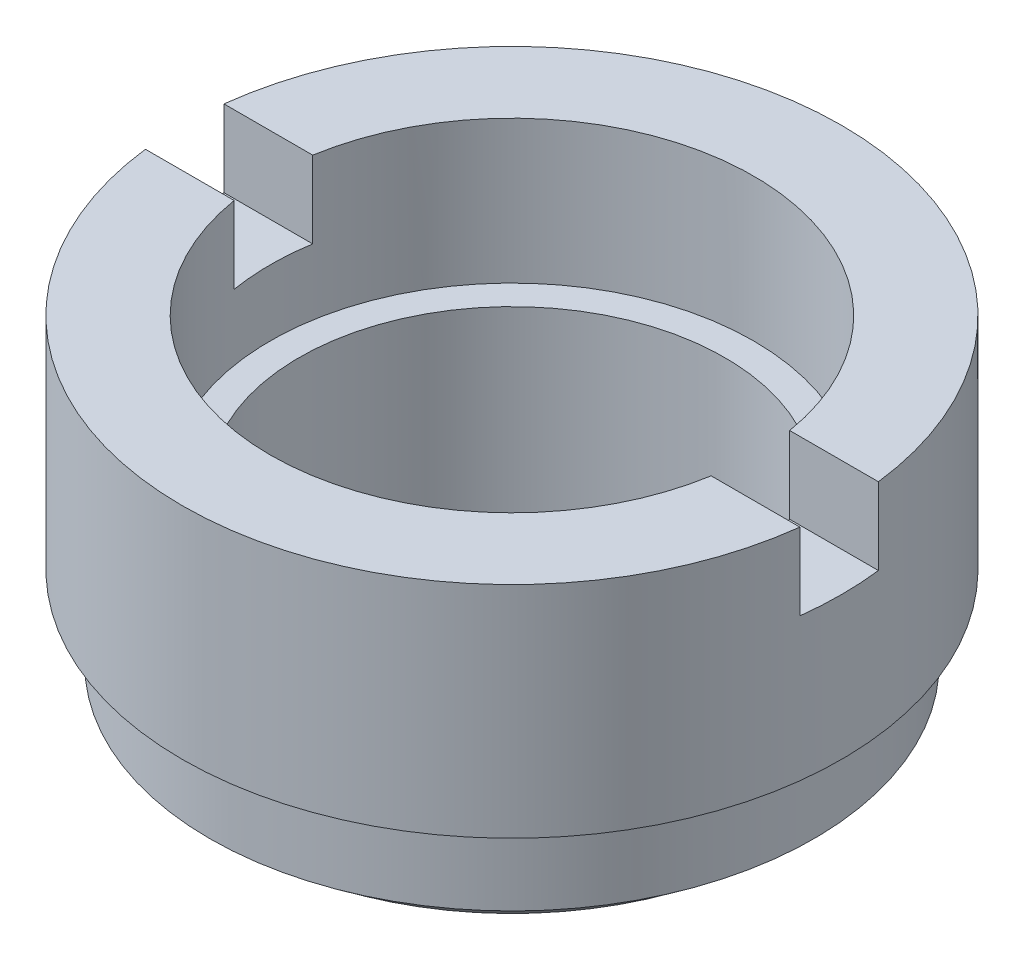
from build123d import *

# Parameters (mm, degrees)
ESQUISSE2_W             = 15
ESQUISSE2_H             = 1.43
ENL_V_MAT_EXTRU_1_DEPTH = 1.4


with BuildPart() as part:
    # Esquisse1 → Base-R_volution (revolve)
    with BuildSketch(Plane.XY, mode=Mode.PRIVATE) as base_r_volution_sk:
        Polygon((-3.875, 0), (-4.85, 0), (-5.5, 0.5), (-5.5, 2), (-6, 2), (-6, 6), (-4.4, 6), (-4.4, 3.4), (-3.875, 3.4), align=None)
    revolve(base_r_volution_sk.sketch.rotate(Axis((0, 50, 0), (0, -1, 0)), 270), axis=Axis((0, 50, 0), (0, -1, 0)))

    # Esquisse2 → Enl_v. mat.-Extru.1 (cut)
    with BuildSketch(Plane(origin=(0, 6, 0), x_dir=(-1, 0, 0), z_dir=(0, 1, 0))):
        Rectangle(ESQUISSE2_W, ESQUISSE2_H)
    extrude(amount=-ENL_V_MAT_EXTRU_1_DEPTH, mode=Mode.SUBTRACT)


solid = part.part
